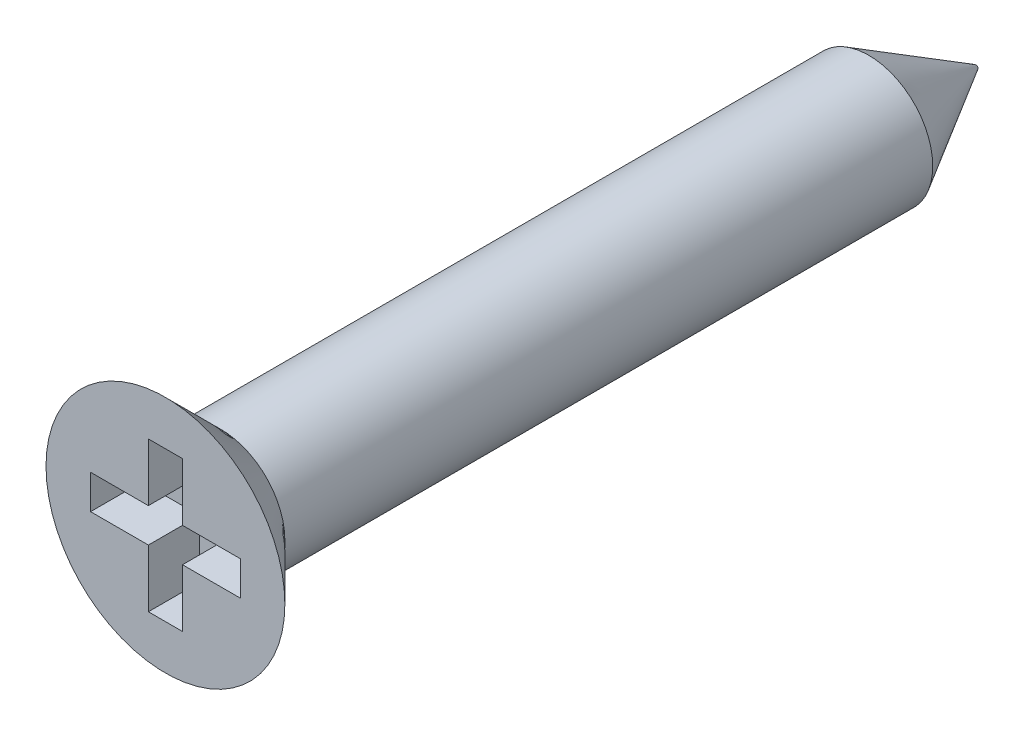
ISO-10303-21;
HEADER;
FILE_DESCRIPTION(('STEP AP214'),'2;1');
FILE_NAME('part.step','',(''),(''),'','','');
FILE_SCHEMA(('AUTOMOTIVE_DESIGN { 1 0 10303 214 1 1 1 1 }'));
ENDSEC;
DATA;
#1=APPLICATION_CONTEXT('core data for automotive mechanical design processes');
#2=APPLICATION_PROTOCOL_DEFINITION('international standard','automotive_design',2000,#1);
#3=PRODUCT_CONTEXT('',#1,'mechanical');
#4=PRODUCT('Part','Part','',(#3));
#5=PRODUCT_RELATED_PRODUCT_CATEGORY('part','',(#4));
#6=PRODUCT_DEFINITION_FORMATION('','',#4);
#7=PRODUCT_DEFINITION_CONTEXT('part definition',#1,'design');
#8=PRODUCT_DEFINITION('design','',#6,#7);
#9=PRODUCT_DEFINITION_SHAPE('','',#8);
#10=(LENGTH_UNIT() NAMED_UNIT(*) SI_UNIT(.MILLI.,.METRE.));
#11=(NAMED_UNIT(*) PLANE_ANGLE_UNIT() SI_UNIT($,.RADIAN.));
#12=(NAMED_UNIT(*) SI_UNIT($,.STERADIAN.) SOLID_ANGLE_UNIT());
#13=UNCERTAINTY_MEASURE_WITH_UNIT(LENGTH_MEASURE(1.E-05),#10,'distance_accuracy_value','');
#14=(GEOMETRIC_REPRESENTATION_CONTEXT(3) GLOBAL_UNCERTAINTY_ASSIGNED_CONTEXT((#13)) GLOBAL_UNIT_ASSIGNED_CONTEXT((#10,
#11,#12)) REPRESENTATION_CONTEXT('',''));
#15=CARTESIAN_POINT('',(0.,0.,0.));
#16=DIRECTION('',(0.,0.,1.));
#17=DIRECTION('',(1.,0.,0.));
#18=AXIS2_PLACEMENT_3D('',#15,#16,#17);
#19=CARTESIAN_POINT('',(0.,2.8,0.));
#20=DIRECTION('',(0.,0.,-1.));
#21=DIRECTION('',(-1.,0.,0.));
#22=AXIS2_PLACEMENT_3D('',#19,#20,#21);
#23=PLANE('',#22);
#24=DIRECTION('',(1.,0.,0.));
#25=VECTOR('',#24,1.);
#26=CARTESIAN_POINT('',(-1.75499287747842,-0.4,0.));
#27=LINE('',#26,#25);
#28=CARTESIAN_POINT('',(-1.75499287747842,-0.4,0.));
#29=VERTEX_POINT('',#28);
#30=CARTESIAN_POINT('',(-0.4,-0.4,0.));
#31=VERTEX_POINT('',#30);
#32=EDGE_CURVE('E160',#29,#31,#27,.T.);
#33=ORIENTED_EDGE('',*,*,#32,.F.);
#34=DIRECTION('',(0.,-1.,0.));
#35=VECTOR('',#34,1.);
#36=CARTESIAN_POINT('',(-1.75499287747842,-0.4,0.));
#37=LINE('',#36,#35);
#38=CARTESIAN_POINT('',(-1.75499287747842,0.4,0.));
#39=VERTEX_POINT('',#38);
#40=EDGE_CURVE('E47',#39,#29,#37,.T.);
#41=ORIENTED_EDGE('',*,*,#40,.F.);
#42=DIRECTION('',(-1.,0.,0.));
#43=VECTOR('',#42,1.);
#44=CARTESIAN_POINT('',(-1.75499287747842,0.4,0.));
#45=LINE('',#44,#43);
#46=CARTESIAN_POINT('',(-0.4,0.4,0.));
#47=VERTEX_POINT('',#46);
#48=EDGE_CURVE('E154',#47,#39,#45,.T.);
#49=ORIENTED_EDGE('',*,*,#48,.F.);
#50=DIRECTION('',(0.,-1.,0.));
#51=VECTOR('',#50,1.);
#52=CARTESIAN_POINT('',(-0.4,1.75499287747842,0.));
#53=LINE('',#52,#51);
#54=CARTESIAN_POINT('',(-0.4,1.75499287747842,0.));
#55=VERTEX_POINT('',#54);
#56=EDGE_CURVE('E210',#55,#47,#53,.T.);
#57=ORIENTED_EDGE('',*,*,#56,.F.);
#58=DIRECTION('',(-1.,0.,0.));
#59=VECTOR('',#58,1.);
#60=CARTESIAN_POINT('',(-0.4,1.75499287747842,0.));
#61=LINE('',#60,#59);
#62=CARTESIAN_POINT('',(0.4,1.75499287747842,0.));
#63=VERTEX_POINT('',#62);
#64=EDGE_CURVE('E207',#63,#55,#61,.T.);
#65=ORIENTED_EDGE('',*,*,#64,.F.);
#66=DIRECTION('',(0.,1.,0.));
#67=VECTOR('',#66,1.);
#68=CARTESIAN_POINT('',(0.4,1.75499287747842,0.));
#69=LINE('',#68,#67);
#70=CARTESIAN_POINT('',(0.4,0.4,0.));
#71=VERTEX_POINT('',#70);
#72=EDGE_CURVE('E204',#71,#63,#69,.T.);
#73=ORIENTED_EDGE('',*,*,#72,.F.);
#74=DIRECTION('',(-1.,0.,0.));
#75=VECTOR('',#74,1.);
#76=CARTESIAN_POINT('',(0.4,0.4,0.));
#77=LINE('',#76,#75);
#78=CARTESIAN_POINT('',(1.75499287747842,0.4,0.));
#79=VERTEX_POINT('',#78);
#80=EDGE_CURVE('E201',#79,#71,#77,.T.);
#81=ORIENTED_EDGE('',*,*,#80,.F.);
#82=DIRECTION('',(0.,1.,0.));
#83=VECTOR('',#82,1.);
#84=CARTESIAN_POINT('',(1.75499287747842,0.4,0.));
#85=LINE('',#84,#83);
#86=CARTESIAN_POINT('',(1.75499287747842,-0.4,0.));
#87=VERTEX_POINT('',#86);
#88=EDGE_CURVE('E198',#87,#79,#85,.T.);
#89=ORIENTED_EDGE('',*,*,#88,.F.);
#90=DIRECTION('',(1.,0.,0.));
#91=VECTOR('',#90,1.);
#92=CARTESIAN_POINT('',(0.4,-0.4,0.));
#93=LINE('',#92,#91);
#94=CARTESIAN_POINT('',(0.4,-0.4,0.));
#95=VERTEX_POINT('',#94);
#96=EDGE_CURVE('E195',#95,#87,#93,.T.);
#97=ORIENTED_EDGE('',*,*,#96,.F.);
#98=DIRECTION('',(0.,1.,0.));
#99=VECTOR('',#98,1.);
#100=CARTESIAN_POINT('',(0.4,-0.4,0.));
#101=LINE('',#100,#99);
#102=CARTESIAN_POINT('',(0.4,-1.75499287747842,0.));
#103=VERTEX_POINT('',#102);
#104=EDGE_CURVE('E192',#103,#95,#101,.T.);
#105=ORIENTED_EDGE('',*,*,#104,.F.);
#106=DIRECTION('',(1.,0.,0.));
#107=VECTOR('',#106,1.);
#108=CARTESIAN_POINT('',(0.4,-1.75499287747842,0.));
#109=LINE('',#108,#107);
#110=CARTESIAN_POINT('',(-0.4,-1.75499287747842,0.));
#111=VERTEX_POINT('',#110);
#112=EDGE_CURVE('E189',#111,#103,#109,.T.);
#113=ORIENTED_EDGE('',*,*,#112,.F.);
#114=DIRECTION('',(0.,-1.,0.));
#115=VECTOR('',#114,1.);
#116=CARTESIAN_POINT('',(-0.4,-0.4,0.));
#117=LINE('',#116,#115);
#118=EDGE_CURVE('E187',#31,#111,#117,.T.);
#119=ORIENTED_EDGE('',*,*,#118,.F.);
#120=EDGE_LOOP('',(#33,#41,#49,#57,#65,#73,#81,#89,#97,#105,#113,#119));
#121=FACE_BOUND('',#120,.T.);
#122=CARTESIAN_POINT('',(0.,0.,0.));
#123=DIRECTION('',(0.,0.,1.));
#124=DIRECTION('',(1.,0.,0.));
#125=AXIS2_PLACEMENT_3D('',#122,#123,#124);
#126=CIRCLE('',#125,2.8);
#127=CARTESIAN_POINT('',(2.8,0.,0.));
#128=VERTEX_POINT('',#127);
#129=EDGE_CURVE('E238',#128,#128,#126,.T.);
#130=ORIENTED_EDGE('',*,*,#129,.T.);
#131=EDGE_LOOP('',(#130));
#132=FACE_BOUND('',#131,.T.);
#133=ADVANCED_FACE('F32',(#121,#132),#23,.F.);
#134=CARTESIAN_POINT('',(0.,0.,-1.3));
#135=DIRECTION('',(0.,0.,1.));
#136=DIRECTION('',(1.,0.,0.));
#137=AXIS2_PLACEMENT_3D('',#134,#135,#136);
#138=CONICAL_SURFACE('',#137,1.5,0.78539816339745);
#139=CARTESIAN_POINT('',(-0.886268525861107,1.75499287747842,-0.833919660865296));
#140=CARTESIAN_POINT('',(-0.831489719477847,1.75499287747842,-0.858604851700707));
#141=CARTESIAN_POINT('',(-0.775987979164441,1.75499287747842,-0.881807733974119));
#142=CARTESIAN_POINT('',(-0.663412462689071,1.75499287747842,-0.924529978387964));
#143=CARTESIAN_POINT('',(-0.606334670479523,1.75499287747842,-0.944038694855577));
#144=CARTESIAN_POINT('',(-0.491308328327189,1.75499287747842,-0.978350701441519));
#145=CARTESIAN_POINT('',(-0.433372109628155,1.75499287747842,-0.993194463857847));
#146=CARTESIAN_POINT('',(-0.316466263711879,1.75499287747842,-1.01761933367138));
#147=CARTESIAN_POINT('',(-0.257497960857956,1.75499287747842,-1.02720673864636));
#148=CARTESIAN_POINT('',(-0.111349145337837,1.75499287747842,-1.04358187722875));
#149=CARTESIAN_POINT('',(-0.023760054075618,1.75499287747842,-1.04701250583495));
#150=CARTESIAN_POINT('',(0.151083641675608,1.75499287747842,-1.04069320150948));
#151=CARTESIAN_POINT('',(0.238337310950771,1.75499287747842,-1.03091854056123));
#152=CARTESIAN_POINT('',(0.459092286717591,1.75499287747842,-0.990797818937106));
#153=CARTESIAN_POINT('',(0.59094842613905,1.75499287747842,-0.951963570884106));
#154=CARTESIAN_POINT('',(0.847616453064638,1.75499287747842,-0.854691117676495));
#155=CARTESIAN_POINT('',(0.972420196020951,1.75499287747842,-0.796230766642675));
#156=CARTESIAN_POINT('',(1.09280763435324,1.75499287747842,-0.732579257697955));
#157=B_SPLINE_CURVE_WITH_KNOTS('',3,(#139,#140,#141,#142,#143,#144,#145,#146,#147,#148,#149,
#150,#151,#152,#153,#154,#155,#156),.UNSPECIFIED.,.F.,.F.,(4,2,2,2,2,2,2,2,4),(0.,
0.180304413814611,0.36112076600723,0.540322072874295,0.719308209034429,0.981250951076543,
1.24368488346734,1.65399961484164,2.06477890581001),.UNSPECIFIED.);
#158=CARTESIAN_POINT('',(0.4,1.75499287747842,-0.999999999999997));
#159=VERTEX_POINT('',#158);
#160=CARTESIAN_POINT('',(-0.4,1.75499287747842,-0.999999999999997));
#161=VERTEX_POINT('',#160);
#162=EDGE_CURVE('E352',#159,#161,#157,.F.);
#163=ORIENTED_EDGE('',*,*,#162,.T.);
#164=CARTESIAN_POINT('',(-0.4,3.05465508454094,0.280733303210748));
#165=CARTESIAN_POINT('',(-0.4,2.93740544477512,0.164488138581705));
#166=CARTESIAN_POINT('',(-0.4,2.82011039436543,0.0482885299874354));
#167=CARTESIAN_POINT('',(-0.4,2.58535518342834,-0.183944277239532));
#168=CARTESIAN_POINT('',(-0.4,2.46789502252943,-0.299977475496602));
#169=CARTESIAN_POINT('',(-0.4,2.23276367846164,-0.531774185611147));
#170=CARTESIAN_POINT('',(-0.4,2.11509255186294,-0.647537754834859));
#171=CARTESIAN_POINT('',(-0.4,1.87936564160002,-0.878680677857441));
#172=CARTESIAN_POINT('',(-0.4,1.7613098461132,-0.994060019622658));
#173=CARTESIAN_POINT('',(-0.4,1.56030925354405,-1.18935151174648));
#174=CARTESIAN_POINT('',(-0.4,1.47753807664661,-1.26944225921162));
#175=CARTESIAN_POINT('',(-0.4,1.31147700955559,-1.42907447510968));
#176=CARTESIAN_POINT('',(-0.4,1.22818715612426,-1.5086159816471));
#177=CARTESIAN_POINT('',(-0.4,1.10255289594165,-1.62721046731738));
#178=CARTESIAN_POINT('',(-0.4,1.06055264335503,-1.66662748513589));
#179=CARTESIAN_POINT('',(-0.4,0.976229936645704,-1.74511218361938));
#180=CARTESIAN_POINT('',(-0.4,0.933907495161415,-1.78417987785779));
#181=CARTESIAN_POINT('',(-0.4,0.848803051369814,-1.86183524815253));
#182=CARTESIAN_POINT('',(-0.4,0.80602094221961,-1.90042280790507));
#183=CARTESIAN_POINT('',(-0.4,0.719742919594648,-1.97680170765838));
#184=CARTESIAN_POINT('',(-0.4,0.676246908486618,-2.01459293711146));
#185=CARTESIAN_POINT('',(-0.4,0.63226772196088,-2.05182724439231));
#186=B_SPLINE_CURVE_WITH_KNOTS('',3,(#164,#165,#166,#167,#168,#169,#170,#171,#172,#173,#174,
#175,#176,#177,#178,#179,#180,#181,#182,#183,#184,#185),.UNSPECIFIED.,.F.,.F.,(4,2,2,2,2,2,2,2,
2,2,4),(0.,0.495322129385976,0.990645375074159,1.48585130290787,1.98107259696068,
2.32660062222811,2.67210443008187,2.84490192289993,3.01769267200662,3.19052449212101,
3.36338014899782),.UNSPECIFIED.);
#187=CARTESIAN_POINT('',(-0.4,1.54919333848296,-1.2));
#188=VERTEX_POINT('',#187);
#189=EDGE_CURVE('E358',#161,#188,#186,.T.);
#190=ORIENTED_EDGE('',*,*,#189,.T.);
#191=CARTESIAN_POINT('',(0.,0.,-1.2));
#192=DIRECTION('',(0.,0.,-1.));
#193=DIRECTION('',(-1.,0.,0.));
#194=AXIS2_PLACEMENT_3D('',#191,#192,#193);
#195=CIRCLE('',#194,1.6);
#196=CARTESIAN_POINT('',(0.4,1.54919333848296,-1.2));
#197=VERTEX_POINT('',#196);
#198=EDGE_CURVE('E243',#188,#197,#195,.T.);
#199=ORIENTED_EDGE('',*,*,#198,.T.);
#200=CARTESIAN_POINT('',(0.4,0.632267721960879,-2.05182724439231));
#201=CARTESIAN_POINT('',(0.4,0.660191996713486,-2.02821617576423));
#202=CARTESIAN_POINT('',(0.4,0.687907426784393,-2.0043616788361));
#203=CARTESIAN_POINT('',(0.4,0.743005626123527,-1.95627497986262));
#204=CARTESIAN_POINT('',(0.4,0.770388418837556,-1.93204280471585));
#205=CARTESIAN_POINT('',(0.4,0.852162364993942,-1.85894632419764));
#206=CARTESIAN_POINT('',(0.4,0.906188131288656,-1.80967429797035));
#207=CARTESIAN_POINT('',(0.4,1.01362648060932,-1.71049682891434));
#208=CARTESIAN_POINT('',(0.4,1.06703921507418,-1.66059154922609));
#209=CARTESIAN_POINT('',(0.4,1.17347006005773,-1.56035783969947));
#210=CARTESIAN_POINT('',(0.4,1.22648815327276,-1.51002939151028));
#211=CARTESIAN_POINT('',(0.4,1.34024896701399,-1.40145173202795));
#212=CARTESIAN_POINT('',(0.4,1.40094711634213,-1.34315589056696));
#213=CARTESIAN_POINT('',(0.4,1.52209811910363,-1.22630068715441));
#214=CARTESIAN_POINT('',(0.4,1.58255095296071,-1.16774130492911));
#215=CARTESIAN_POINT('',(0.4,1.76134065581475,-0.994030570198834));
#216=CARTESIAN_POINT('',(0.4,1.87942666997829,-0.878621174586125));
#217=CARTESIAN_POINT('',(0.4,2.11521819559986,-0.647414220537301));
#218=CARTESIAN_POINT('',(0.4,2.23292370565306,-0.53161666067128));
#219=CARTESIAN_POINT('',(0.4,2.46805734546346,-0.29981721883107));
#220=CARTESIAN_POINT('',(0.4,2.58548555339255,-0.183815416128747));
#221=CARTESIAN_POINT('',(0.4,2.82017598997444,0.0483535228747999));
#222=CARTESIAN_POINT('',(0.4,2.93743822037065,0.164520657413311));
#223=CARTESIAN_POINT('',(0.4,3.05465508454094,0.280733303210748));
#224=B_SPLINE_CURVE_WITH_KNOTS('',3,(#200,#201,#202,#203,#204,#205,#206,#207,#208,#209,#210,
#211,#212,#213,#214,#215,#216,#217,#218,#219,#220,#221,#222,#223),.UNSPECIFIED.,.F.,.F.,(4,2,2,
2,2,2,2,2,2,2,2,4),(0.,0.109700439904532,0.219393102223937,0.438742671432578,0.658036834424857,
0.877340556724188,1.12981526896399,1.38230974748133,1.87765889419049,2.3730098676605,
2.86819872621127,3.36338234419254),.UNSPECIFIED.);
#225=EDGE_CURVE('E330',#197,#159,#224,.T.);
#226=ORIENTED_EDGE('',*,*,#225,.T.);
#227=EDGE_LOOP('',(#163,#190,#199,#226));
#228=FACE_BOUND('',#227,.T.);
#229=CARTESIAN_POINT('',(1.75499287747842,-0.886268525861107,-0.833919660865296));
#230=CARTESIAN_POINT('',(1.75499287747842,-0.831489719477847,-0.858604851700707));
#231=CARTESIAN_POINT('',(1.75499287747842,-0.775987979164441,-0.881807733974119));
#232=CARTESIAN_POINT('',(1.75499287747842,-0.663412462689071,-0.924529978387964));
#233=CARTESIAN_POINT('',(1.75499287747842,-0.606334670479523,-0.944038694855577));
#234=CARTESIAN_POINT('',(1.75499287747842,-0.491308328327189,-0.978350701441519));
#235=CARTESIAN_POINT('',(1.75499287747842,-0.433372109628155,-0.993194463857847));
#236=CARTESIAN_POINT('',(1.75499287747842,-0.316466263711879,-1.01761933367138));
#237=CARTESIAN_POINT('',(1.75499287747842,-0.257497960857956,-1.02720673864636));
#238=CARTESIAN_POINT('',(1.75499287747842,-0.111349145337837,-1.04358187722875));
#239=CARTESIAN_POINT('',(1.75499287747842,-0.023760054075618,-1.04701250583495));
#240=CARTESIAN_POINT('',(1.75499287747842,0.151083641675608,-1.04069320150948));
#241=CARTESIAN_POINT('',(1.75499287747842,0.238337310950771,-1.03091854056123));
#242=CARTESIAN_POINT('',(1.75499287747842,0.459092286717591,-0.990797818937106));
#243=CARTESIAN_POINT('',(1.75499287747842,0.59094842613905,-0.951963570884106));
#244=CARTESIAN_POINT('',(1.75499287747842,0.847616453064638,-0.854691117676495));
#245=CARTESIAN_POINT('',(1.75499287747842,0.972420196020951,-0.796230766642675));
#246=CARTESIAN_POINT('',(1.75499287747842,1.09280763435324,-0.732579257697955));
#247=B_SPLINE_CURVE_WITH_KNOTS('',3,(#229,#230,#231,#232,#233,#234,#235,#236,#237,#238,#239,
#240,#241,#242,#243,#244,#245,#246),.UNSPECIFIED.,.F.,.F.,(4,2,2,2,2,2,2,2,4),(0.,
0.180304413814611,0.36112076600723,0.540322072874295,0.719308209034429,0.981250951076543,
1.24368488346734,1.65399961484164,2.06477890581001),.UNSPECIFIED.);
#248=CARTESIAN_POINT('',(1.75499287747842,-0.4,-0.999999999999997));
#249=VERTEX_POINT('',#248);
#250=CARTESIAN_POINT('',(1.75499287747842,0.4,-0.999999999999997));
#251=VERTEX_POINT('',#250);
#252=EDGE_CURVE('E317',#249,#251,#247,.T.);
#253=ORIENTED_EDGE('',*,*,#252,.T.);
#254=CARTESIAN_POINT('',(3.05465508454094,0.4,0.280733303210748));
#255=CARTESIAN_POINT('',(2.93740544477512,0.4,0.164488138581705));
#256=CARTESIAN_POINT('',(2.82011039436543,0.4,0.0482885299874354));
#257=CARTESIAN_POINT('',(2.58535518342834,0.4,-0.183944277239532));
#258=CARTESIAN_POINT('',(2.46789502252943,0.4,-0.299977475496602));
#259=CARTESIAN_POINT('',(2.23276367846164,0.4,-0.531774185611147));
#260=CARTESIAN_POINT('',(2.11509255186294,0.4,-0.647537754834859));
#261=CARTESIAN_POINT('',(1.87936564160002,0.4,-0.878680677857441));
#262=CARTESIAN_POINT('',(1.7613098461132,0.4,-0.994060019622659));
#263=CARTESIAN_POINT('',(1.56030925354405,0.4,-1.18935151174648));
#264=CARTESIAN_POINT('',(1.47753807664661,0.4,-1.26944225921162));
#265=CARTESIAN_POINT('',(1.31147700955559,0.4,-1.42907447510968));
#266=CARTESIAN_POINT('',(1.22818715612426,0.4,-1.5086159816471));
#267=CARTESIAN_POINT('',(1.10255289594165,0.4,-1.62721046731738));
#268=CARTESIAN_POINT('',(1.06055264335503,0.4,-1.66662748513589));
#269=CARTESIAN_POINT('',(0.976229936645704,0.4,-1.74511218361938));
#270=CARTESIAN_POINT('',(0.933907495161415,0.4,-1.78417987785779));
#271=CARTESIAN_POINT('',(0.848803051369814,0.4,-1.86183524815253));
#272=CARTESIAN_POINT('',(0.80602094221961,0.4,-1.90042280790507));
#273=CARTESIAN_POINT('',(0.719742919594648,0.4,-1.97680170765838));
#274=CARTESIAN_POINT('',(0.676246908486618,0.4,-2.01459293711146));
#275=CARTESIAN_POINT('',(0.63226772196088,0.4,-2.05182724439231));
#276=B_SPLINE_CURVE_WITH_KNOTS('',3,(#254,#255,#256,#257,#258,#259,#260,#261,#262,#263,#264,
#265,#266,#267,#268,#269,#270,#271,#272,#273,#274,#275),.UNSPECIFIED.,.F.,.F.,(4,2,2,2,2,2,2,2,
2,2,4),(0.,0.495322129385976,0.990645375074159,1.48585130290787,1.98107259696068,
2.32660062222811,2.67210443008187,2.84490192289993,3.01769267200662,3.19052449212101,
3.36338014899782),.UNSPECIFIED.);
#277=CARTESIAN_POINT('',(1.54919333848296,0.4,-1.2));
#278=VERTEX_POINT('',#277);
#279=EDGE_CURVE('E324',#251,#278,#276,.T.);
#280=ORIENTED_EDGE('',*,*,#279,.T.);
#281=CARTESIAN_POINT('',(1.54919333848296,-0.4,-1.2));
#282=VERTEX_POINT('',#281);
#283=EDGE_CURVE('E318',#278,#282,#195,.T.);
#284=ORIENTED_EDGE('',*,*,#283,.T.);
#285=CARTESIAN_POINT('',(0.63226772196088,-0.4,-2.05182724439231));
#286=CARTESIAN_POINT('',(0.660191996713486,-0.4,-2.02821617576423));
#287=CARTESIAN_POINT('',(0.687907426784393,-0.4,-2.0043616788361));
#288=CARTESIAN_POINT('',(0.743005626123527,-0.4,-1.95627497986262));
#289=CARTESIAN_POINT('',(0.770388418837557,-0.4,-1.93204280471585));
#290=CARTESIAN_POINT('',(0.852162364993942,-0.4,-1.85894632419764));
#291=CARTESIAN_POINT('',(0.906188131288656,-0.4,-1.80967429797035));
#292=CARTESIAN_POINT('',(1.01362648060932,-0.4,-1.71049682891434));
#293=CARTESIAN_POINT('',(1.06703921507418,-0.4,-1.66059154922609));
#294=CARTESIAN_POINT('',(1.17347006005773,-0.4,-1.56035783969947));
#295=CARTESIAN_POINT('',(1.22648815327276,-0.4,-1.51002939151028));
#296=CARTESIAN_POINT('',(1.34024896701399,-0.4,-1.40145173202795));
#297=CARTESIAN_POINT('',(1.40094711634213,-0.4,-1.34315589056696));
#298=CARTESIAN_POINT('',(1.52209811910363,-0.4,-1.22630068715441));
#299=CARTESIAN_POINT('',(1.58255095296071,-0.4,-1.16774130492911));
#300=CARTESIAN_POINT('',(1.76134065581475,-0.4,-0.994030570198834));
#301=CARTESIAN_POINT('',(1.87942666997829,-0.4,-0.878621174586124));
#302=CARTESIAN_POINT('',(2.11521819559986,-0.4,-0.6474142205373));
#303=CARTESIAN_POINT('',(2.23292370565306,-0.4,-0.531616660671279));
#304=CARTESIAN_POINT('',(2.46805734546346,-0.4,-0.29981721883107));
#305=CARTESIAN_POINT('',(2.58548555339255,-0.4,-0.183815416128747));
#306=CARTESIAN_POINT('',(2.82017598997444,-0.4,0.0483535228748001));
#307=CARTESIAN_POINT('',(2.93743822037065,-0.4,0.164520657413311));
#308=CARTESIAN_POINT('',(3.05465508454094,-0.4,0.280733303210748));
#309=B_SPLINE_CURVE_WITH_KNOTS('',3,(#285,#286,#287,#288,#289,#290,#291,#292,#293,#294,#295,
#296,#297,#298,#299,#300,#301,#302,#303,#304,#305,#306,#307,#308),.UNSPECIFIED.,.F.,.F.,(4,2,2,
2,2,2,2,2,2,2,2,4),(0.,0.109700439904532,0.219393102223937,0.438742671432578,0.658036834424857,
0.877340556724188,1.12981526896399,1.38230974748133,1.8776588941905,2.3730098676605,
2.86819872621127,3.36338234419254),.UNSPECIFIED.);
#310=EDGE_CURVE('E311',#282,#249,#309,.T.);
#311=ORIENTED_EDGE('',*,*,#310,.T.);
#312=EDGE_LOOP('',(#253,#280,#284,#311));
#313=FACE_BOUND('',#312,.T.);
#314=CARTESIAN_POINT('',(-0.886268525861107,-1.75499287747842,-0.833919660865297));
#315=CARTESIAN_POINT('',(-0.831489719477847,-1.75499287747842,-0.858604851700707));
#316=CARTESIAN_POINT('',(-0.775987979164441,-1.75499287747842,-0.881807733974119));
#317=CARTESIAN_POINT('',(-0.663412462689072,-1.75499287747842,-0.924529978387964));
#318=CARTESIAN_POINT('',(-0.606334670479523,-1.75499287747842,-0.944038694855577));
#319=CARTESIAN_POINT('',(-0.491308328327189,-1.75499287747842,-0.978350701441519));
#320=CARTESIAN_POINT('',(-0.433372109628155,-1.75499287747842,-0.993194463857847));
#321=CARTESIAN_POINT('',(-0.316466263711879,-1.75499287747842,-1.01761933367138));
#322=CARTESIAN_POINT('',(-0.257497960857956,-1.75499287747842,-1.02720673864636));
#323=CARTESIAN_POINT('',(-0.111349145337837,-1.75499287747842,-1.04358187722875));
#324=CARTESIAN_POINT('',(-0.0237600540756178,-1.75499287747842,-1.04701250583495));
#325=CARTESIAN_POINT('',(0.151083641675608,-1.75499287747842,-1.04069320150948));
#326=CARTESIAN_POINT('',(0.238337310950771,-1.75499287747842,-1.03091854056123));
#327=CARTESIAN_POINT('',(0.459092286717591,-1.75499287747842,-0.990797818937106));
#328=CARTESIAN_POINT('',(0.59094842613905,-1.75499287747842,-0.951963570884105));
#329=CARTESIAN_POINT('',(0.847616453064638,-1.75499287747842,-0.854691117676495));
#330=CARTESIAN_POINT('',(0.972420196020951,-1.75499287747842,-0.796230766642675));
#331=CARTESIAN_POINT('',(1.09280763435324,-1.75499287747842,-0.732579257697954));
#332=B_SPLINE_CURVE_WITH_KNOTS('',3,(#314,#315,#316,#317,#318,#319,#320,#321,#322,#323,#324,
#325,#326,#327,#328,#329,#330,#331),.UNSPECIFIED.,.F.,.F.,(4,2,2,2,2,2,2,2,4),(0.,
0.180304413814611,0.36112076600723,0.540322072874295,0.719308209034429,0.981250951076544,
1.24368488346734,1.65399961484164,2.06477890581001),.UNSPECIFIED.);
#333=CARTESIAN_POINT('',(-0.4,-1.75499287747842,-0.999999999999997));
#334=VERTEX_POINT('',#333);
#335=CARTESIAN_POINT('',(0.4,-1.75499287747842,-0.999999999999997));
#336=VERTEX_POINT('',#335);
#337=EDGE_CURVE('E282',#334,#336,#332,.T.);
#338=ORIENTED_EDGE('',*,*,#337,.T.);
#339=CARTESIAN_POINT('',(0.4,-3.05465508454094,0.280733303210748));
#340=CARTESIAN_POINT('',(0.4,-2.93740544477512,0.164488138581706));
#341=CARTESIAN_POINT('',(0.4,-2.82011039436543,0.0482885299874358));
#342=CARTESIAN_POINT('',(0.4,-2.58535518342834,-0.183944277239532));
#343=CARTESIAN_POINT('',(0.4,-2.46789502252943,-0.299977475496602));
#344=CARTESIAN_POINT('',(0.4,-2.23276367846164,-0.531774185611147));
#345=CARTESIAN_POINT('',(0.4,-2.11509255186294,-0.647537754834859));
#346=CARTESIAN_POINT('',(0.4,-1.87936564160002,-0.878680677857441));
#347=CARTESIAN_POINT('',(0.4,-1.7613098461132,-0.994060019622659));
#348=CARTESIAN_POINT('',(0.4,-1.56030925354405,-1.18935151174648));
#349=CARTESIAN_POINT('',(0.4,-1.47753807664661,-1.26944225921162));
#350=CARTESIAN_POINT('',(0.4,-1.31147700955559,-1.42907447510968));
#351=CARTESIAN_POINT('',(0.4,-1.22818715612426,-1.5086159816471));
#352=CARTESIAN_POINT('',(0.4,-1.10255289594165,-1.62721046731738));
#353=CARTESIAN_POINT('',(0.4,-1.06055264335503,-1.66662748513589));
#354=CARTESIAN_POINT('',(0.4,-0.976229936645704,-1.74511218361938));
#355=CARTESIAN_POINT('',(0.4,-0.933907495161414,-1.78417987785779));
#356=CARTESIAN_POINT('',(0.4,-0.848803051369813,-1.86183524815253));
#357=CARTESIAN_POINT('',(0.4,-0.806020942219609,-1.90042280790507));
#358=CARTESIAN_POINT('',(0.4,-0.719742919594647,-1.97680170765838));
#359=CARTESIAN_POINT('',(0.4,-0.676246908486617,-2.01459293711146));
#360=CARTESIAN_POINT('',(0.4,-0.632267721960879,-2.05182724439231));
#361=B_SPLINE_CURVE_WITH_KNOTS('',3,(#339,#340,#341,#342,#343,#344,#345,#346,#347,#348,#349,
#350,#351,#352,#353,#354,#355,#356,#357,#358,#359,#360),.UNSPECIFIED.,.F.,.F.,(4,2,2,2,2,2,2,2,
2,2,4),(0.,0.495322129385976,0.990645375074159,1.48585130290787,1.98107259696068,
2.32660062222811,2.67210443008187,2.84490192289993,3.01769267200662,3.19052449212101,
3.36338014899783),.UNSPECIFIED.);
#362=CARTESIAN_POINT('',(0.4,-1.54919333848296,-1.2));
#363=VERTEX_POINT('',#362);
#364=EDGE_CURVE('E288',#336,#363,#361,.T.);
#365=ORIENTED_EDGE('',*,*,#364,.T.);
#366=CARTESIAN_POINT('',(-0.4,-1.54919333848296,-1.2));
#367=VERTEX_POINT('',#366);
#368=EDGE_CURVE('E244',#363,#367,#195,.T.);
#369=ORIENTED_EDGE('',*,*,#368,.T.);
#370=CARTESIAN_POINT('',(-0.4,-0.63226772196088,-2.05182724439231));
#371=CARTESIAN_POINT('',(-0.4,-0.660191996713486,-2.02821617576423));
#372=CARTESIAN_POINT('',(-0.4,-0.687907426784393,-2.0043616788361));
#373=CARTESIAN_POINT('',(-0.4,-0.743005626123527,-1.95627497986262));
#374=CARTESIAN_POINT('',(-0.4,-0.770388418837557,-1.93204280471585));
#375=CARTESIAN_POINT('',(-0.4,-0.852162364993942,-1.85894632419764));
#376=CARTESIAN_POINT('',(-0.4,-0.906188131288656,-1.80967429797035));
#377=CARTESIAN_POINT('',(-0.4,-1.01362648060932,-1.71049682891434));
#378=CARTESIAN_POINT('',(-0.4,-1.06703921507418,-1.66059154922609));
#379=CARTESIAN_POINT('',(-0.4,-1.17347006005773,-1.56035783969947));
#380=CARTESIAN_POINT('',(-0.4,-1.22648815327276,-1.51002939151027));
#381=CARTESIAN_POINT('',(-0.4,-1.34024896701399,-1.40145173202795));
#382=CARTESIAN_POINT('',(-0.4,-1.40094711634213,-1.34315589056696));
#383=CARTESIAN_POINT('',(-0.4,-1.52209811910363,-1.22630068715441));
#384=CARTESIAN_POINT('',(-0.4,-1.58255095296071,-1.16774130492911));
#385=CARTESIAN_POINT('',(-0.4,-1.76134065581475,-0.994030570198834));
#386=CARTESIAN_POINT('',(-0.4,-1.87942666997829,-0.878621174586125));
#387=CARTESIAN_POINT('',(-0.4,-2.11521819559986,-0.647414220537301));
#388=CARTESIAN_POINT('',(-0.4,-2.23292370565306,-0.53161666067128));
#389=CARTESIAN_POINT('',(-0.4,-2.46805734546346,-0.299817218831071));
#390=CARTESIAN_POINT('',(-0.4,-2.58548555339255,-0.183815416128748));
#391=CARTESIAN_POINT('',(-0.4,-2.82017598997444,0.0483535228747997));
#392=CARTESIAN_POINT('',(-0.4,-2.93743822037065,0.164520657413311));
#393=CARTESIAN_POINT('',(-0.4,-3.05465508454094,0.280733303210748));
#394=B_SPLINE_CURVE_WITH_KNOTS('',3,(#370,#371,#372,#373,#374,#375,#376,#377,#378,#379,#380,
#381,#382,#383,#384,#385,#386,#387,#388,#389,#390,#391,#392,#393),.UNSPECIFIED.,.F.,.F.,(4,2,2,
2,2,2,2,2,2,2,2,4),(0.,0.109700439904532,0.219393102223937,0.438742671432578,0.658036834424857,
0.877340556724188,1.12981526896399,1.38230974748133,1.87765889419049,2.3730098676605,
2.86819872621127,3.36338234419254),.UNSPECIFIED.);
#395=EDGE_CURVE('E170',#367,#334,#394,.T.);
#396=ORIENTED_EDGE('',*,*,#395,.T.);
#397=EDGE_LOOP('',(#338,#365,#369,#396));
#398=FACE_BOUND('',#397,.T.);
#399=CARTESIAN_POINT('',(-0.63226772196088,0.4,-2.05182724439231));
#400=CARTESIAN_POINT('',(-0.660191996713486,0.4,-2.02821617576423));
#401=CARTESIAN_POINT('',(-0.687907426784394,0.4,-2.0043616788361));
#402=CARTESIAN_POINT('',(-0.743005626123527,0.4,-1.95627497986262));
#403=CARTESIAN_POINT('',(-0.770388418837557,0.4,-1.93204280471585));
#404=CARTESIAN_POINT('',(-0.852162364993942,0.4,-1.85894632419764));
#405=CARTESIAN_POINT('',(-0.906188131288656,0.4,-1.80967429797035));
#406=CARTESIAN_POINT('',(-1.01362648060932,0.4,-1.71049682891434));
#407=CARTESIAN_POINT('',(-1.06703921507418,0.4,-1.66059154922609));
#408=CARTESIAN_POINT('',(-1.17347006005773,0.4,-1.56035783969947));
#409=CARTESIAN_POINT('',(-1.22648815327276,0.4,-1.51002939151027));
#410=CARTESIAN_POINT('',(-1.34024896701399,0.4,-1.40145173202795));
#411=CARTESIAN_POINT('',(-1.40094711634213,0.4,-1.34315589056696));
#412=CARTESIAN_POINT('',(-1.52209811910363,0.4,-1.22630068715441));
#413=CARTESIAN_POINT('',(-1.58255095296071,0.4,-1.16774130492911));
#414=CARTESIAN_POINT('',(-1.76134065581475,0.4,-0.994030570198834));
#415=CARTESIAN_POINT('',(-1.87942666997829,0.4,-0.878621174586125));
#416=CARTESIAN_POINT('',(-2.11521819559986,0.4,-0.647414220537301));
#417=CARTESIAN_POINT('',(-2.23292370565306,0.4,-0.53161666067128));
#418=CARTESIAN_POINT('',(-2.46805734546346,0.4,-0.299817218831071));
#419=CARTESIAN_POINT('',(-2.58548555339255,0.4,-0.183815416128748));
#420=CARTESIAN_POINT('',(-2.82017598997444,0.4,0.0483535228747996));
#421=CARTESIAN_POINT('',(-2.93743822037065,0.4,0.164520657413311));
#422=CARTESIAN_POINT('',(-3.05465508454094,0.4,0.280733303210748));
#423=B_SPLINE_CURVE_WITH_KNOTS('',3,(#399,#400,#401,#402,#403,#404,#405,#406,#407,#408,#409,
#410,#411,#412,#413,#414,#415,#416,#417,#418,#419,#420,#421,#422),.UNSPECIFIED.,.F.,.F.,(4,2,2,
2,2,2,2,2,2,2,2,4),(0.,0.109700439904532,0.219393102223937,0.438742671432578,0.658036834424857,
0.877340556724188,1.12981526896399,1.38230974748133,1.87765889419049,2.3730098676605,
2.86819872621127,3.36338234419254),.UNSPECIFIED.);
#424=CARTESIAN_POINT('',(-1.54919333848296,0.4,-1.2));
#425=VERTEX_POINT('',#424);
#426=CARTESIAN_POINT('',(-1.75499287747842,0.4,-0.999999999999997));
#427=VERTEX_POINT('',#426);
#428=EDGE_CURVE('E251',#425,#427,#423,.T.);
#429=ORIENTED_EDGE('',*,*,#428,.T.);
#430=CARTESIAN_POINT('',(-1.75499287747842,-0.886268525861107,-0.833919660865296));
#431=CARTESIAN_POINT('',(-1.75499287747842,-0.831489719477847,-0.858604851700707));
#432=CARTESIAN_POINT('',(-1.75499287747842,-0.775987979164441,-0.881807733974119));
#433=CARTESIAN_POINT('',(-1.75499287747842,-0.663412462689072,-0.924529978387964));
#434=CARTESIAN_POINT('',(-1.75499287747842,-0.606334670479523,-0.944038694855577));
#435=CARTESIAN_POINT('',(-1.75499287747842,-0.491308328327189,-0.978350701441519));
#436=CARTESIAN_POINT('',(-1.75499287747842,-0.433372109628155,-0.993194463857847));
#437=CARTESIAN_POINT('',(-1.75499287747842,-0.316466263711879,-1.01761933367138));
#438=CARTESIAN_POINT('',(-1.75499287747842,-0.257497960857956,-1.02720673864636));
#439=CARTESIAN_POINT('',(-1.75499287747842,-0.111349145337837,-1.04358187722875));
#440=CARTESIAN_POINT('',(-1.75499287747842,-0.023760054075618,-1.04701250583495));
#441=CARTESIAN_POINT('',(-1.75499287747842,0.151083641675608,-1.04069320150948));
#442=CARTESIAN_POINT('',(-1.75499287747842,0.238337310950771,-1.03091854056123));
#443=CARTESIAN_POINT('',(-1.75499287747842,0.459092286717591,-0.990797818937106));
#444=CARTESIAN_POINT('',(-1.75499287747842,0.59094842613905,-0.951963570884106));
#445=CARTESIAN_POINT('',(-1.75499287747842,0.847616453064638,-0.854691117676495));
#446=CARTESIAN_POINT('',(-1.75499287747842,0.972420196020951,-0.796230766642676));
#447=CARTESIAN_POINT('',(-1.75499287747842,1.09280763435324,-0.732579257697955));
#448=B_SPLINE_CURVE_WITH_KNOTS('',3,(#430,#431,#432,#433,#434,#435,#436,#437,#438,#439,#440,
#441,#442,#443,#444,#445,#446,#447),.UNSPECIFIED.,.F.,.F.,(4,2,2,2,2,2,2,2,4),(0.,
0.180304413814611,0.36112076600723,0.540322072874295,0.719308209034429,0.981250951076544,
1.24368488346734,1.65399961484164,2.06477890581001),.UNSPECIFIED.);
#449=CARTESIAN_POINT('',(-1.75499287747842,-0.4,-0.999999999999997));
#450=VERTEX_POINT('',#449);
#451=EDGE_CURVE('E272',#427,#450,#448,.F.);
#452=ORIENTED_EDGE('',*,*,#451,.T.);
#453=CARTESIAN_POINT('',(-3.05465508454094,-0.4,0.280733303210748));
#454=CARTESIAN_POINT('',(-2.93740544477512,-0.4,0.164488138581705));
#455=CARTESIAN_POINT('',(-2.82011039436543,-0.4,0.0482885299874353));
#456=CARTESIAN_POINT('',(-2.58535518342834,-0.4,-0.183944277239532));
#457=CARTESIAN_POINT('',(-2.46789502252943,-0.4,-0.299977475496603));
#458=CARTESIAN_POINT('',(-2.23276367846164,-0.4,-0.531774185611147));
#459=CARTESIAN_POINT('',(-2.11509255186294,-0.4,-0.647537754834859));
#460=CARTESIAN_POINT('',(-1.87936564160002,-0.4,-0.878680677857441));
#461=CARTESIAN_POINT('',(-1.7613098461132,-0.4,-0.994060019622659));
#462=CARTESIAN_POINT('',(-1.56030925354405,-0.4,-1.18935151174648));
#463=CARTESIAN_POINT('',(-1.47753807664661,-0.4,-1.26944225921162));
#464=CARTESIAN_POINT('',(-1.31147700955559,-0.4,-1.42907447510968));
#465=CARTESIAN_POINT('',(-1.22818715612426,-0.4,-1.5086159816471));
#466=CARTESIAN_POINT('',(-1.10255289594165,-0.4,-1.62721046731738));
#467=CARTESIAN_POINT('',(-1.06055264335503,-0.4,-1.66662748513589));
#468=CARTESIAN_POINT('',(-0.976229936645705,-0.4,-1.74511218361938));
#469=CARTESIAN_POINT('',(-0.933907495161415,-0.4,-1.78417987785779));
#470=CARTESIAN_POINT('',(-0.848803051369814,-0.4,-1.86183524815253));
#471=CARTESIAN_POINT('',(-0.80602094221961,-0.4,-1.90042280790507));
#472=CARTESIAN_POINT('',(-0.719742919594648,-0.4,-1.97680170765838));
#473=CARTESIAN_POINT('',(-0.676246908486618,-0.4,-2.01459293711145));
#474=CARTESIAN_POINT('',(-0.63226772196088,-0.4,-2.05182724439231));
#475=B_SPLINE_CURVE_WITH_KNOTS('',3,(#453,#454,#455,#456,#457,#458,#459,#460,#461,#462,#463,
#464,#465,#466,#467,#468,#469,#470,#471,#472,#473,#474),.UNSPECIFIED.,.F.,.F.,(4,2,2,2,2,2,2,2,
2,2,4),(0.,0.495322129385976,0.990645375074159,1.48585130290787,1.98107259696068,
2.32660062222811,2.67210443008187,2.84490192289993,3.01769267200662,3.19052449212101,
3.36338014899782),.UNSPECIFIED.);
#476=CARTESIAN_POINT('',(-1.54919333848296,-0.4,-1.2));
#477=VERTEX_POINT('',#476);
#478=EDGE_CURVE('E242',#450,#477,#475,.T.);
#479=ORIENTED_EDGE('',*,*,#478,.T.);
#480=EDGE_CURVE('E151',#477,#425,#195,.T.);
#481=ORIENTED_EDGE('',*,*,#480,.T.);
#482=EDGE_LOOP('',(#429,#452,#479,#481));
#483=FACE_BOUND('',#482,.T.);
#484=ORIENTED_EDGE('',*,*,#129,.F.);
#485=EDGE_LOOP('',(#484));
#486=FACE_BOUND('',#485,.T.);
#487=CARTESIAN_POINT('',(0.,0.,-1.3));
#488=DIRECTION('',(0.,0.,1.));
#489=DIRECTION('',(1.,0.,0.));
#490=AXIS2_PLACEMENT_3D('',#487,#488,#489);
#491=CIRCLE('',#490,1.5);
#492=CARTESIAN_POINT('',(1.5,0.,-1.3));
#493=VERTEX_POINT('',#492);
#494=EDGE_CURVE('E217',#493,#493,#491,.T.);
#495=ORIENTED_EDGE('',*,*,#494,.T.);
#496=EDGE_LOOP('',(#495));
#497=FACE_BOUND('',#496,.T.);
#498=ADVANCED_FACE('F257',(#228,#313,#398,#483,#486,#497),#138,.T.);
#499=CARTESIAN_POINT('',(0.,0.,-19.));
#500=DIRECTION('',(0.,0.,1.));
#501=DIRECTION('',(1.,0.,0.));
#502=AXIS2_PLACEMENT_3D('',#499,#500,#501);
#503=CYLINDRICAL_SURFACE('',#502,1.5);
#504=CARTESIAN_POINT('',(0.,0.,-16.4885263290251));
#505=DIRECTION('',(0.,0.,1.));
#506=DIRECTION('',(1.,0.,0.));
#507=AXIS2_PLACEMENT_3D('',#504,#505,#506);
#508=CIRCLE('',#507,1.5);
#509=CARTESIAN_POINT('',(1.5,0.,-16.4885263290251));
#510=VERTEX_POINT('',#509);
#511=EDGE_CURVE('E40',#510,#510,#508,.T.);
#512=ORIENTED_EDGE('',*,*,#511,.T.);
#513=EDGE_LOOP('',(#512));
#514=FACE_BOUND('',#513,.T.);
#515=ORIENTED_EDGE('',*,*,#494,.F.);
#516=EDGE_LOOP('',(#515));
#517=FACE_BOUND('',#516,.T.);
#518=ADVANCED_FACE('F366',(#514,#517),#503,.T.);
#519=CARTESIAN_POINT('',(0.,0.,-19.));
#520=DIRECTION('',(0.,0.,1.));
#521=DIRECTION('',(1.,0.,0.));
#522=AXIS2_PLACEMENT_3D('',#519,#520,#521);
#523=PLANE('',#522);
#524=CARTESIAN_POINT('',(0.,0.,-19.));
#525=DIRECTION('',(0.,0.,1.));
#526=DIRECTION('',(1.,0.,0.));
#527=AXIS2_PLACEMENT_3D('',#524,#525,#526);
#528=CIRCLE('',#527,0.0500000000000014);
#529=CARTESIAN_POINT('',(0.0500000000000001,0.,-19.));
#530=VERTEX_POINT('',#529);
#531=EDGE_CURVE('E11',#530,#530,#528,.F.);
#532=ORIENTED_EDGE('',*,*,#531,.T.);
#533=EDGE_LOOP('',(#532));
#534=FACE_BOUND('',#533,.T.);
#535=ADVANCED_FACE('F271',(#534),#523,.F.);
#536=CARTESIAN_POINT('',(-1.75499287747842,-0.4,-1.2));
#537=DIRECTION('',(-1.,0.,0.));
#538=DIRECTION('',(0.,0.,1.));
#539=AXIS2_PLACEMENT_3D('',#536,#537,#538);
#540=PLANE('',#539);
#541=DIRECTION('',(0.,0.,1.));
#542=VECTOR('',#541,1.);
#543=CARTESIAN_POINT('',(-1.75499287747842,0.4,-1.2));
#544=LINE('',#543,#542);
#545=EDGE_CURVE('E215',#427,#39,#544,.T.);
#546=ORIENTED_EDGE('',*,*,#545,.T.);
#547=ORIENTED_EDGE('',*,*,#40,.T.);
#548=DIRECTION('',(0.,0.,1.));
#549=VECTOR('',#548,1.);
#550=CARTESIAN_POINT('',(-1.75499287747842,-0.4,-1.2));
#551=LINE('',#550,#549);
#552=EDGE_CURVE('E165',#450,#29,#551,.T.);
#553=ORIENTED_EDGE('',*,*,#552,.F.);
#554=ORIENTED_EDGE('',*,*,#451,.F.);
#555=EDGE_LOOP('',(#546,#547,#553,#554));
#556=FACE_BOUND('',#555,.T.);
#557=ADVANCED_FACE('F266',(#556),#540,.F.);
#558=CARTESIAN_POINT('',(-1.75499287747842,0.4,-1.2));
#559=DIRECTION('',(0.,1.,0.));
#560=DIRECTION('',(-1.,0.,0.));
#561=AXIS2_PLACEMENT_3D('',#558,#559,#560);
#562=PLANE('',#561);
#563=DIRECTION('',(-1.,0.,0.));
#564=VECTOR('',#563,1.);
#565=CARTESIAN_POINT('',(-1.75499287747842,0.4,-1.2));
#566=LINE('',#565,#564);
#567=CARTESIAN_POINT('',(-0.4,0.4,-1.2));
#568=VERTEX_POINT('',#567);
#569=EDGE_CURVE('E183',#568,#425,#566,.T.);
#570=ORIENTED_EDGE('',*,*,#569,.F.);
#571=DIRECTION('',(0.,0.,1.));
#572=VECTOR('',#571,1.);
#573=CARTESIAN_POINT('',(-0.4,0.4,-1.2));
#574=LINE('',#573,#572);
#575=EDGE_CURVE('E218',#568,#47,#574,.T.);
#576=ORIENTED_EDGE('',*,*,#575,.T.);
#577=ORIENTED_EDGE('',*,*,#48,.T.);
#578=ORIENTED_EDGE('',*,*,#545,.F.);
#579=ORIENTED_EDGE('',*,*,#428,.F.);
#580=EDGE_LOOP('',(#570,#576,#577,#578,#579));
#581=FACE_BOUND('',#580,.T.);
#582=ADVANCED_FACE('F270',(#581),#562,.F.);
#583=CARTESIAN_POINT('',(-0.4,1.75499287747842,-1.2));
#584=DIRECTION('',(-1.,0.,0.));
#585=DIRECTION('',(0.,-1.,0.));
#586=AXIS2_PLACEMENT_3D('',#583,#584,#585);
#587=PLANE('',#586);
#588=DIRECTION('',(0.,0.,1.));
#589=VECTOR('',#588,1.);
#590=CARTESIAN_POINT('',(-0.4,1.75499287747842,-1.2));
#591=LINE('',#590,#589);
#592=EDGE_CURVE('E220',#161,#55,#591,.T.);
#593=ORIENTED_EDGE('',*,*,#592,.T.);
#594=ORIENTED_EDGE('',*,*,#56,.T.);
#595=ORIENTED_EDGE('',*,*,#575,.F.);
#596=DIRECTION('',(0.,-1.,0.));
#597=VECTOR('',#596,1.);
#598=CARTESIAN_POINT('',(-0.4,1.75499287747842,-1.2));
#599=LINE('',#598,#597);
#600=EDGE_CURVE('E181',#188,#568,#599,.T.);
#601=ORIENTED_EDGE('',*,*,#600,.F.);
#602=ORIENTED_EDGE('',*,*,#189,.F.);
#603=EDGE_LOOP('',(#593,#594,#595,#601,#602));
#604=FACE_BOUND('',#603,.T.);
#605=ADVANCED_FACE('F349',(#604),#587,.F.);
#606=CARTESIAN_POINT('',(-0.4,1.75499287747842,-1.2));
#607=DIRECTION('',(0.,1.,0.));
#608=DIRECTION('',(0.,0.,1.));
#609=AXIS2_PLACEMENT_3D('',#606,#607,#608);
#610=PLANE('',#609);
#611=DIRECTION('',(0.,0.,1.));
#612=VECTOR('',#611,1.);
#613=CARTESIAN_POINT('',(0.4,1.75499287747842,-1.2));
#614=LINE('',#613,#612);
#615=EDGE_CURVE('E222',#159,#63,#614,.T.);
#616=ORIENTED_EDGE('',*,*,#615,.T.);
#617=ORIENTED_EDGE('',*,*,#64,.T.);
#618=ORIENTED_EDGE('',*,*,#592,.F.);
#619=ORIENTED_EDGE('',*,*,#162,.F.);
#620=EDGE_LOOP('',(#616,#617,#618,#619));
#621=FACE_BOUND('',#620,.T.);
#622=ADVANCED_FACE('F344',(#621),#610,.F.);
#623=CARTESIAN_POINT('',(0.4,1.75499287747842,-1.2));
#624=DIRECTION('',(1.,0.,0.));
#625=DIRECTION('',(0.,0.,-1.));
#626=AXIS2_PLACEMENT_3D('',#623,#624,#625);
#627=PLANE('',#626);
#628=DIRECTION('',(0.,1.,0.));
#629=VECTOR('',#628,1.);
#630=CARTESIAN_POINT('',(0.4,1.75499287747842,-1.2));
#631=LINE('',#630,#629);
#632=CARTESIAN_POINT('',(0.4,0.4,-1.2));
#633=VERTEX_POINT('',#632);
#634=EDGE_CURVE('E55',#633,#197,#631,.T.);
#635=ORIENTED_EDGE('',*,*,#634,.F.);
#636=DIRECTION('',(0.,0.,1.));
#637=VECTOR('',#636,1.);
#638=CARTESIAN_POINT('',(0.4,0.4,-1.2));
#639=LINE('',#638,#637);
#640=EDGE_CURVE('E224',#633,#71,#639,.T.);
#641=ORIENTED_EDGE('',*,*,#640,.T.);
#642=ORIENTED_EDGE('',*,*,#72,.T.);
#643=ORIENTED_EDGE('',*,*,#615,.F.);
#644=ORIENTED_EDGE('',*,*,#225,.F.);
#645=EDGE_LOOP('',(#635,#641,#642,#643,#644));
#646=FACE_BOUND('',#645,.T.);
#647=ADVANCED_FACE('F339',(#646),#627,.F.);
#648=CARTESIAN_POINT('',(0.4,0.4,-1.2));
#649=DIRECTION('',(0.,1.,0.));
#650=DIRECTION('',(-1.,0.,0.));
#651=AXIS2_PLACEMENT_3D('',#648,#649,#650);
#652=PLANE('',#651);
#653=DIRECTION('',(0.,0.,1.));
#654=VECTOR('',#653,1.);
#655=CARTESIAN_POINT('',(1.75499287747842,0.4,-1.2));
#656=LINE('',#655,#654);
#657=EDGE_CURVE('E226',#251,#79,#656,.T.);
#658=ORIENTED_EDGE('',*,*,#657,.T.);
#659=ORIENTED_EDGE('',*,*,#80,.T.);
#660=ORIENTED_EDGE('',*,*,#640,.F.);
#661=DIRECTION('',(-1.,0.,0.));
#662=VECTOR('',#661,1.);
#663=CARTESIAN_POINT('',(0.4,0.4,-1.2));
#664=LINE('',#663,#662);
#665=EDGE_CURVE('E178',#278,#633,#664,.T.);
#666=ORIENTED_EDGE('',*,*,#665,.F.);
#667=ORIENTED_EDGE('',*,*,#279,.F.);
#668=EDGE_LOOP('',(#658,#659,#660,#666,#667));
#669=FACE_BOUND('',#668,.T.);
#670=ADVANCED_FACE('F336',(#669),#652,.F.);
#671=CARTESIAN_POINT('',(1.75499287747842,0.4,-1.2));
#672=DIRECTION('',(1.,0.,0.));
#673=DIRECTION('',(0.,0.,-1.));
#674=AXIS2_PLACEMENT_3D('',#671,#672,#673);
#675=PLANE('',#674);
#676=DIRECTION('',(0.,0.,1.));
#677=VECTOR('',#676,1.);
#678=CARTESIAN_POINT('',(1.75499287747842,-0.4,-1.2));
#679=LINE('',#678,#677);
#680=EDGE_CURVE('E228',#249,#87,#679,.T.);
#681=ORIENTED_EDGE('',*,*,#680,.T.);
#682=ORIENTED_EDGE('',*,*,#88,.T.);
#683=ORIENTED_EDGE('',*,*,#657,.F.);
#684=ORIENTED_EDGE('',*,*,#252,.F.);
#685=EDGE_LOOP('',(#681,#682,#683,#684));
#686=FACE_BOUND('',#685,.T.);
#687=ADVANCED_FACE('F307',(#686),#675,.F.);
#688=CARTESIAN_POINT('',(0.4,-0.4,-1.2));
#689=DIRECTION('',(0.,-1.,0.));
#690=DIRECTION('',(1.,0.,0.));
#691=AXIS2_PLACEMENT_3D('',#688,#689,#690);
#692=PLANE('',#691);
#693=DIRECTION('',(1.,0.,0.));
#694=VECTOR('',#693,1.);
#695=CARTESIAN_POINT('',(0.4,-0.4,-1.2));
#696=LINE('',#695,#694);
#697=CARTESIAN_POINT('',(0.4,-0.4,-1.2));
#698=VERTEX_POINT('',#697);
#699=EDGE_CURVE('E174',#698,#282,#696,.T.);
#700=ORIENTED_EDGE('',*,*,#699,.F.);
#701=DIRECTION('',(0.,0.,1.));
#702=VECTOR('',#701,1.);
#703=CARTESIAN_POINT('',(0.4,-0.4,-1.2));
#704=LINE('',#703,#702);
#705=EDGE_CURVE('E230',#698,#95,#704,.T.);
#706=ORIENTED_EDGE('',*,*,#705,.T.);
#707=ORIENTED_EDGE('',*,*,#96,.T.);
#708=ORIENTED_EDGE('',*,*,#680,.F.);
#709=ORIENTED_EDGE('',*,*,#310,.F.);
#710=EDGE_LOOP('',(#700,#706,#707,#708,#709));
#711=FACE_BOUND('',#710,.T.);
#712=ADVANCED_FACE('F302',(#711),#692,.F.);
#713=CARTESIAN_POINT('',(0.4,-0.4,-1.2));
#714=DIRECTION('',(1.,0.,0.));
#715=DIRECTION('',(0.,1.,0.));
#716=AXIS2_PLACEMENT_3D('',#713,#714,#715);
#717=PLANE('',#716);
#718=DIRECTION('',(0.,0.,1.));
#719=VECTOR('',#718,1.);
#720=CARTESIAN_POINT('',(0.4,-1.75499287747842,-1.2));
#721=LINE('',#720,#719);
#722=EDGE_CURVE('E232',#336,#103,#721,.T.);
#723=ORIENTED_EDGE('',*,*,#722,.T.);
#724=ORIENTED_EDGE('',*,*,#104,.T.);
#725=ORIENTED_EDGE('',*,*,#705,.F.);
#726=DIRECTION('',(0.,1.,0.));
#727=VECTOR('',#726,1.);
#728=CARTESIAN_POINT('',(0.4,-0.4,-1.2));
#729=LINE('',#728,#727);
#730=EDGE_CURVE('E172',#363,#698,#729,.T.);
#731=ORIENTED_EDGE('',*,*,#730,.F.);
#732=ORIENTED_EDGE('',*,*,#364,.F.);
#733=EDGE_LOOP('',(#723,#724,#725,#731,#732));
#734=FACE_BOUND('',#733,.T.);
#735=ADVANCED_FACE('F297',(#734),#717,.F.);
#736=CARTESIAN_POINT('',(0.4,-1.75499287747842,-1.2));
#737=DIRECTION('',(0.,-1.,0.));
#738=DIRECTION('',(1.,0.,0.));
#739=AXIS2_PLACEMENT_3D('',#736,#737,#738);
#740=PLANE('',#739);
#741=DIRECTION('',(0.,0.,1.));
#742=VECTOR('',#741,1.);
#743=CARTESIAN_POINT('',(-0.4,-1.75499287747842,-1.2));
#744=LINE('',#743,#742);
#745=EDGE_CURVE('E164',#334,#111,#744,.T.);
#746=ORIENTED_EDGE('',*,*,#745,.T.);
#747=ORIENTED_EDGE('',*,*,#112,.T.);
#748=ORIENTED_EDGE('',*,*,#722,.F.);
#749=ORIENTED_EDGE('',*,*,#337,.F.);
#750=EDGE_LOOP('',(#746,#747,#748,#749));
#751=FACE_BOUND('',#750,.T.);
#752=ADVANCED_FACE('F294',(#751),#740,.F.);
#753=CARTESIAN_POINT('',(-0.4,-0.4,-1.2));
#754=DIRECTION('',(-1.,0.,0.));
#755=DIRECTION('',(0.,-1.,0.));
#756=AXIS2_PLACEMENT_3D('',#753,#754,#755);
#757=PLANE('',#756);
#758=DIRECTION('',(0.,-1.,0.));
#759=VECTOR('',#758,1.);
#760=CARTESIAN_POINT('',(-0.4,-0.4,-1.2));
#761=LINE('',#760,#759);
#762=CARTESIAN_POINT('',(-0.4,-0.4,-1.2));
#763=VERTEX_POINT('',#762);
#764=EDGE_CURVE('E148',#763,#367,#761,.T.);
#765=ORIENTED_EDGE('',*,*,#764,.F.);
#766=DIRECTION('',(0.,0.,1.));
#767=VECTOR('',#766,1.);
#768=CARTESIAN_POINT('',(-0.4,-0.4,-1.2));
#769=LINE('',#768,#767);
#770=EDGE_CURVE('E157',#763,#31,#769,.T.);
#771=ORIENTED_EDGE('',*,*,#770,.T.);
#772=ORIENTED_EDGE('',*,*,#118,.T.);
#773=ORIENTED_EDGE('',*,*,#745,.F.);
#774=ORIENTED_EDGE('',*,*,#395,.F.);
#775=EDGE_LOOP('',(#765,#771,#772,#773,#774));
#776=FACE_BOUND('',#775,.T.);
#777=ADVANCED_FACE('F167',(#776),#757,.F.);
#778=CARTESIAN_POINT('',(-1.75499287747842,-0.4,-1.2));
#779=DIRECTION('',(0.,-1.,0.));
#780=DIRECTION('',(1.,0.,0.));
#781=AXIS2_PLACEMENT_3D('',#778,#779,#780);
#782=PLANE('',#781);
#783=ORIENTED_EDGE('',*,*,#552,.T.);
#784=ORIENTED_EDGE('',*,*,#32,.T.);
#785=ORIENTED_EDGE('',*,*,#770,.F.);
#786=DIRECTION('',(1.,0.,0.));
#787=VECTOR('',#786,1.);
#788=CARTESIAN_POINT('',(-1.75499287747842,-0.4,-1.2));
#789=LINE('',#788,#787);
#790=EDGE_CURVE('E144',#477,#763,#789,.T.);
#791=ORIENTED_EDGE('',*,*,#790,.F.);
#792=ORIENTED_EDGE('',*,*,#478,.F.);
#793=EDGE_LOOP('',(#783,#784,#785,#791,#792));
#794=FACE_BOUND('',#793,.T.);
#795=ADVANCED_FACE('F158',(#794),#782,.F.);
#796=CARTESIAN_POINT('',(-1.75499287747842,1.75499287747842,-1.2));
#797=DIRECTION('',(0.,0.,-1.));
#798=DIRECTION('',(-1.,0.,0.));
#799=AXIS2_PLACEMENT_3D('',#796,#797,#798);
#800=PLANE('',#799);
#801=ORIENTED_EDGE('',*,*,#600,.T.);
#802=ORIENTED_EDGE('',*,*,#569,.T.);
#803=ORIENTED_EDGE('',*,*,#480,.F.);
#804=ORIENTED_EDGE('',*,*,#790,.T.);
#805=ORIENTED_EDGE('',*,*,#764,.T.);
#806=ORIENTED_EDGE('',*,*,#368,.F.);
#807=ORIENTED_EDGE('',*,*,#730,.T.);
#808=ORIENTED_EDGE('',*,*,#699,.T.);
#809=ORIENTED_EDGE('',*,*,#283,.F.);
#810=ORIENTED_EDGE('',*,*,#665,.T.);
#811=ORIENTED_EDGE('',*,*,#634,.T.);
#812=ORIENTED_EDGE('',*,*,#198,.F.);
#813=EDGE_LOOP('',(#801,#802,#803,#804,#805,#806,#807,#808,#809,#810,#811,#812));
#814=FACE_BOUND('',#813,.T.);
#815=ADVANCED_FACE('F146',(#814),#800,.F.);
#816=CARTESIAN_POINT('',(0.,0.,-16.4885263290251));
#817=DIRECTION('',(0.,0.,1.));
#818=DIRECTION('',(1.,0.,0.));
#819=AXIS2_PLACEMENT_3D('',#816,#817,#818);
#820=CONICAL_SURFACE('',#819,1.5,0.523598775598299);
#821=CARTESIAN_POINT('',(0.0500000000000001,0.,-19.));
#822=CARTESIAN_POINT('',(0.0651041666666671,0.,-18.9738388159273));
#823=CARTESIAN_POINT('',(0.0802083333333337,0.,-18.9476776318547));
#824=CARTESIAN_POINT('',(0.110416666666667,0.,-18.8953552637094));
#825=CARTESIAN_POINT('',(0.125520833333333,0.,-18.8691940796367));
#826=CARTESIAN_POINT('',(0.155729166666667,0.,-18.8168717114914));
#827=CARTESIAN_POINT('',(0.170833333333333,0.,-18.7907105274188));
#828=CARTESIAN_POINT('',(0.201041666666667,0.,-18.7383881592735));
#829=CARTESIAN_POINT('',(0.216145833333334,0.,-18.7122269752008));
#830=CARTESIAN_POINT('',(0.246354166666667,0.,-18.6599046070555));
#831=CARTESIAN_POINT('',(0.261458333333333,0.,-18.6337434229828));
#832=CARTESIAN_POINT('',(0.291666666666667,0.,-18.5814210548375));
#833=CARTESIAN_POINT('',(0.306770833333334,0.,-18.5552598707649));
#834=CARTESIAN_POINT('',(0.336979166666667,0.,-18.5029375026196));
#835=CARTESIAN_POINT('',(0.352083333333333,0.,-18.4767763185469));
#836=CARTESIAN_POINT('',(0.382291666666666,0.,-18.4244539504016));
#837=CARTESIAN_POINT('',(0.397395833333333,0.,-18.3982927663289));
#838=CARTESIAN_POINT('',(0.427604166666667,0.,-18.3459703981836));
#839=CARTESIAN_POINT('',(0.442708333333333,0.,-18.319809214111));
#840=CARTESIAN_POINT('',(0.472916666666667,0.,-18.2674868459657));
#841=CARTESIAN_POINT('',(0.488020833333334,0.,-18.241325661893));
#842=CARTESIAN_POINT('',(0.518229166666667,0.,-18.1890032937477));
#843=CARTESIAN_POINT('',(0.533333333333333,0.,-18.162842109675));
#844=CARTESIAN_POINT('',(0.563541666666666,0.,-18.1105197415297));
#845=CARTESIAN_POINT('',(0.578645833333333,0.,-18.0843585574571));
#846=CARTESIAN_POINT('',(0.608854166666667,0.,-18.0320361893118));
#847=CARTESIAN_POINT('',(0.623958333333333,0.,-18.0058750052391));
#848=CARTESIAN_POINT('',(0.654166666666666,0.,-17.9535526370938));
#849=CARTESIAN_POINT('',(0.669270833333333,0.,-17.9273914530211));
#850=CARTESIAN_POINT('',(0.699479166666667,0.,-17.8750690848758));
#851=CARTESIAN_POINT('',(0.714583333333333,0.,-17.8489079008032));
#852=CARTESIAN_POINT('',(0.744791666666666,0.,-17.7965855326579));
#853=CARTESIAN_POINT('',(0.759895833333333,0.,-17.7704243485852));
#854=CARTESIAN_POINT('',(0.790104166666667,0.,-17.7181019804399));
#855=CARTESIAN_POINT('',(0.805208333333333,0.,-17.6919407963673));
#856=CARTESIAN_POINT('',(0.835416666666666,0.,-17.6396184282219));
#857=CARTESIAN_POINT('',(0.850520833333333,0.,-17.6134572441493));
#858=CARTESIAN_POINT('',(0.880729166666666,0.,-17.561134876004));
#859=CARTESIAN_POINT('',(0.895833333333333,0.,-17.5349736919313));
#860=CARTESIAN_POINT('',(0.926041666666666,0.,-17.482651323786));
#861=CARTESIAN_POINT('',(0.941145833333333,0.,-17.4564901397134));
#862=CARTESIAN_POINT('',(0.971354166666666,0.,-17.4041677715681));
#863=CARTESIAN_POINT('',(0.986458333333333,0.,-17.3780065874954));
#864=CARTESIAN_POINT('',(1.01666666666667,0.,-17.3256842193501));
#865=CARTESIAN_POINT('',(1.03177083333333,0.,-17.2995230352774));
#866=CARTESIAN_POINT('',(1.06197916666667,0.,-17.2472006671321));
#867=CARTESIAN_POINT('',(1.07708333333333,0.,-17.2210394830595));
#868=CARTESIAN_POINT('',(1.10729166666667,0.,-17.1687171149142));
#869=CARTESIAN_POINT('',(1.12239583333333,0.,-17.1425559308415));
#870=CARTESIAN_POINT('',(1.15260416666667,0.,-17.0902335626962));
#871=CARTESIAN_POINT('',(1.16770833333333,0.,-17.0640723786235));
#872=CARTESIAN_POINT('',(1.19791666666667,0.,-17.0117500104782));
#873=CARTESIAN_POINT('',(1.21302083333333,0.,-16.9855888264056));
#874=CARTESIAN_POINT('',(1.24322916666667,0.,-16.9332664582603));
#875=CARTESIAN_POINT('',(1.25833333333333,0.,-16.9071052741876));
#876=CARTESIAN_POINT('',(1.28854166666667,0.,-16.8547829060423));
#877=CARTESIAN_POINT('',(1.30364583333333,0.,-16.8286217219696));
#878=CARTESIAN_POINT('',(1.33385416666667,0.,-16.7762993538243));
#879=CARTESIAN_POINT('',(1.34895833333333,0.,-16.7501381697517));
#880=CARTESIAN_POINT('',(1.37916666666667,0.,-16.6978158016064));
#881=CARTESIAN_POINT('',(1.39427083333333,0.,-16.6716546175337));
#882=CARTESIAN_POINT('',(1.42447916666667,0.,-16.6193322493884));
#883=CARTESIAN_POINT('',(1.43958333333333,0.,-16.5931710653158));
#884=CARTESIAN_POINT('',(1.46979166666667,0.,-16.5408486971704));
#885=CARTESIAN_POINT('',(1.48489583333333,0.,-16.5146875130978));
#886=CARTESIAN_POINT('',(1.5,0.,-16.4885263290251));
#887=B_SPLINE_CURVE_WITH_KNOTS('',3,(#821,#822,#823,#824,#825,#826,#827,#828,#829,#830,#831,
#832,#833,#834,#835,#836,#837,#838,#839,#840,#841,#842,#843,#844,#845,#846,#847,#848,#849,#850,
#851,#852,#853,#854,#855,#856,#857,#858,#859,#860,#861,#862,#863,#864,#865,#866,#867,#868,#869,
#870,#871,#872,#873,#874,#875,#876,#877,#878,#879,#880,#881,#882,#883,#884,#885,#886),
.UNSPECIFIED.,.F.,.F.,(4,2,2,2,2,2,2,2,2,2,2,2,2,2,2,2,2,2,2,2,2,2,2,2,2,2,2,2,2,2,2,2,4),(0.,
0.0906250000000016,0.181250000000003,0.271875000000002,0.3625,0.453125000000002,0.54375,
0.634375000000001,0.725,0.815625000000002,0.90625,0.996875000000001,1.0875,1.178125,1.26875,
1.359375,1.45,1.540625,1.63125,1.721875,1.8125,1.903125,1.99375,2.084375,2.175,2.265625,2.35625,
2.446875,2.5375,2.628125,2.71875,2.809375,2.9),.UNSPECIFIED.);
#888=EDGE_CURVE('BSEAM34',#530,#510,#887,.T.);
#889=ORIENTED_EDGE('',*,*,#531,.F.);
#890=ORIENTED_EDGE('',*,*,#511,.F.);
#891=ORIENTED_EDGE('',*,*,#888,.T.);
#892=ORIENTED_EDGE('',*,*,#888,.F.);
#893=EDGE_LOOP('',(#889,#891,#890,#892));
#894=FACE_BOUND('',#893,.T.);
#895=ADVANCED_FACE('F34',(#894),#820,.T.);
#896=CLOSED_SHELL('',(#133,#498,#518,#535,#557,#582,#605,#622,#647,#670,#687,#712,#735,#752,
#777,#795,#815,#895));
#897=MANIFOLD_SOLID_BREP('B2',#896);
#898=ADVANCED_BREP_SHAPE_REPRESENTATION('',(#18,#897),#14);
#899=SHAPE_DEFINITION_REPRESENTATION(#9,#898);
ENDSEC;
END-ISO-10303-21;
